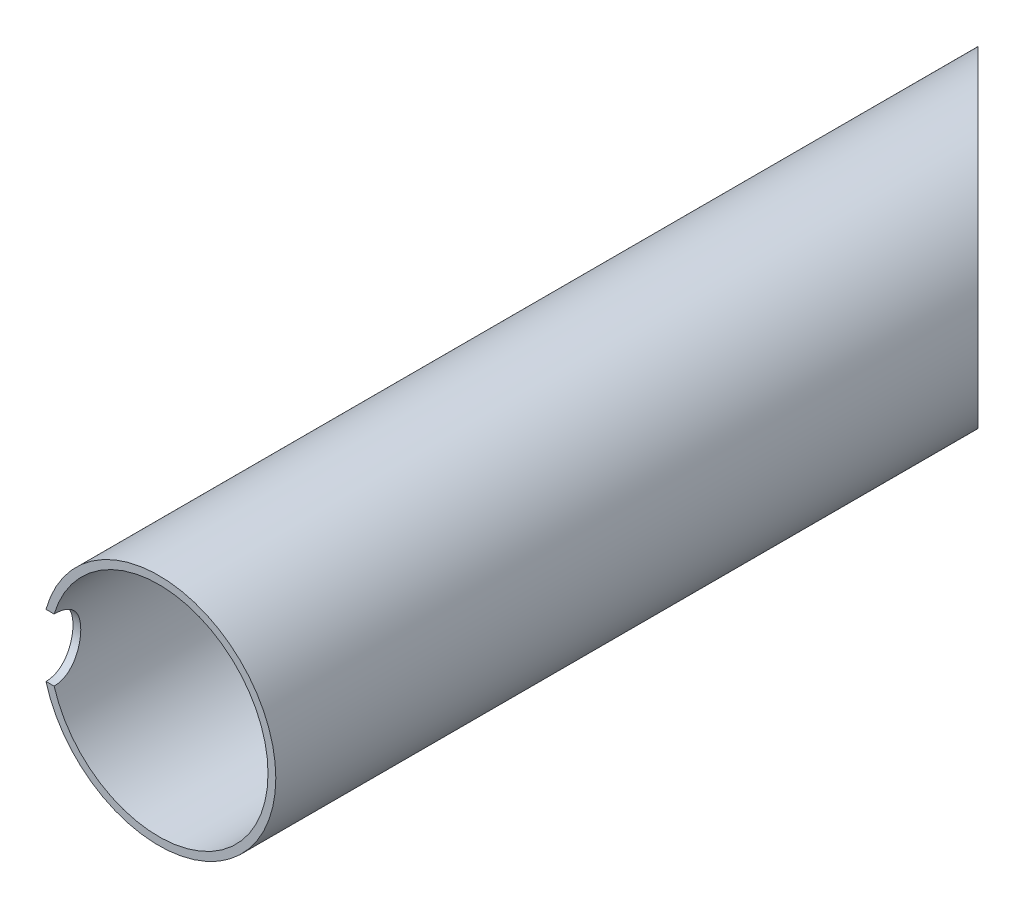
from build123d import *

# Parameters (mm, degrees)
IZIM1_R                     = 15
IZIM1_R_2                   = 14
Y_KSEKLIK_EKSTR_ZYON1_DEPTH = 120
KES_EKSTR_ZYON1_DEPTH       = 60
IZIM3_RX                    = 33.420855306
IZIM3_RY                    = 20.066479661
Y_KSEKLIK_EKSTR_ZYON2_DEPTH = 5
KES_EKSTR_ZYON2_START       = -155
IZIM4_R                     = 35.18425131
IZIM4_R_2                   = 15
KES_EKSTR_ZYON2_DEPTH       = 155
IZIM5_R                     = 1
KES_EKSTR_ZYON3_DEPTH       = 155
IZIM12_R                    = 1.6
KES_EKSTR_ZYON4_DEPTH       = 1.6
KES_EKSTR_ZYON5_DEPTH       = 40.8
KES_EKSTR_ZYON6_DEPTH       = 0.6


with BuildPart() as part:
    # izim1 → Y_kseklik-Ekstr_zyon1 (new body)
    with BuildSketch(Plane.XY):
        Circle(IZIM1_R)
        Circle(IZIM1_R_2, mode=Mode.SUBTRACT)
    extrude(amount=Y_KSEKLIK_EKSTR_ZYON1_DEPTH)

    # izim2 → Kes-Ekstr_zyon1 (cut, symmetric)
    with BuildSketch(Plane(origin=(0, 0, 0), x_dir=(1, 0, 0), z_dir=(0, 1, 0))):
        Polygon((-23.057079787, 8.057079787), (28.666442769, -43.666442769), (30.09373887, 12.111766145), align=None)
    extrude(amount=KES_EKSTR_ZYON1_DEPTH, both=True, mode=Mode.SUBTRACT)

    # izim3 → Y_kseklik-Ekstr_zyon2 (add)
    with BuildSketch(Plane(origin=(-7.5, 0, 7.5), x_dir=(-0.7071067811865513, 0, -0.7071067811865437), z_dir=(0.7071067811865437, 0, -0.7071067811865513))):
        with Locations(Location((-10.606601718, 0), (0, 0, 180))):
            Ellipse(IZIM3_RX, IZIM3_RY)
    extrude(amount=-Y_KSEKLIK_EKSTR_ZYON2_DEPTH)

    # izim4 → Kes-Ekstr_zyon2 (cut)
    with BuildSketch(Plane.XY.offset(120).offset(KES_EKSTR_ZYON2_START)):
        Circle(IZIM4_R)
        Circle(IZIM4_R_2, mode=Mode.SUBTRACT)
    extrude(amount=KES_EKSTR_ZYON2_DEPTH, mode=Mode.SUBTRACT)

    # izim5 → Kes-Ekstr_zyon3 (cut)
    with BuildSketch(Plane.XY.offset(120)):
        with Locations((0, -1.5)):
            Circle(IZIM5_R)
        with Locations((0, 1.5)):
            Circle(IZIM5_R)
    extrude(amount=-KES_EKSTR_ZYON3_DEPTH, mode=Mode.SUBTRACT)

    # izim12 → Kes-Ekstr_zyon4 (cut)
    with BuildSketch(Plane(origin=(-7.5, 0, 7.5), x_dir=(-0.7071067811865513, 0, -0.7071067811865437), z_dir=(0.7071067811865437, 0, -0.7071067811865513))):
        with Locations((-15.606601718, 0)):
            Circle(IZIM12_R)
        with Locations((-10.606601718, 5)):
            Circle(IZIM12_R)
        with Locations((-5.606601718, 0)):
            Circle(IZIM12_R)
        with Locations((-10.606601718, -5)):
            Circle(IZIM12_R)
    extrude(amount=-KES_EKSTR_ZYON4_DEPTH, mode=Mode.SUBTRACT)

    # izim13 → Kes-Ekstr_zyon5 (cut)
    with BuildSketch(Plane(origin=(0, 0, 0), x_dir=(0, 0, -1), z_dir=(1, 0, 0))):
        with BuildLine():
            Line((-120, 4), (-120, -4))
            ThreePointArc((-120, -4), (-116, 0), (-120, 4))
        make_face()
    extrude(amount=-KES_EKSTR_ZYON5_DEPTH, mode=Mode.SUBTRACT)

    # izim14 → Kes-Ekstr_zyon6 (cut)
    # profile 1 of 17: a face of its own
    with BuildSketch(Plane(origin=(-7.5, 0, 7.5), x_dir=(-0.7071067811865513, 0, -0.7071067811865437), z_dir=(0.7071067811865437, 0, -0.7071067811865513))):
        Polygon((3.212581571, 0.541746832), (3.617950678, 0.589967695), (3.345800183, 2.878891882), (2.940431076, 2.830671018), (3.05094347, 1.900320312), (-0.71514321, 1.451835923), (-0.664615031, 1.026086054), (3.101471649, 1.474570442), align=None)
    # profile 2 of 17: a face of its own
    with BuildSketch(Plane(origin=(-7.5, 0, 7.5), x_dir=(-0.7071067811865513, 0, -0.7071067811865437), z_dir=(0.7071067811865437, 0, -0.7071067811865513))):
        with BuildLine():
            Line((2.802049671, 4.661098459), (2.458628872, 5.429420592))
            add(Edge.make_bspline(
                [(2.458628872, 5.429420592), (2.434836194, 5.48241698), (2.389410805, 5.583598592), (2.321782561, 5.727616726), (2.258303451, 5.856933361), (2.199662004, 5.972598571), (2.145332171, 6.074010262), (2.094107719, 6.160722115), (2.048070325, 6.233750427), (2.016617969, 6.276107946), (2.002301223, 6.295388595)],
                knots=[0, 0, 0, 0, 1.42182561, 2.714573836, 3.893992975, 4.947558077, 5.888594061, 6.709116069, 7.412404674, 8, 8, 8, 8], degree=3))
            add(Edge.make_bspline(
                [(2.002301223, 6.295388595), (1.983198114, 6.319297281), (1.945337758, 6.366681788), (1.881809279, 6.430637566), (1.815448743, 6.489585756), (1.744509, 6.541272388), (1.67035911, 6.58729575), (1.592529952, 6.626936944), (1.511373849, 6.661190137), (1.426624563, 6.688066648), (1.339593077, 6.708025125), (1.250724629, 6.720066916), (1.160605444, 6.723704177), (1.069343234, 6.717272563), (0.97707986, 6.705069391), (0.883844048, 6.68229744), (0.789346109, 6.652009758), (0.727069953, 6.62603278), (0.695322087, 6.612789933)],
                knots=[0, 0, 0, 0, 1.006379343, 1.994538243, 2.961990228, 3.924600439, 4.878905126, 5.831031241, 6.795930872, 7.774410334, 8.752889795, 9.730705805, 10.72161913, 11.714843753, 12.737936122, 13.780423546, 14.868478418, 16, 16, 16, 16], degree=3))
            add(Edge.make_bspline(
                [(0.695322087, 6.612789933), (0.664094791, 6.598124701), (0.602999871, 6.569432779), (0.516953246, 6.51931574), (0.438362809, 6.464329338), (0.365820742, 6.405695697), (0.300830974, 6.341934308), (0.242928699, 6.273695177), (0.192780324, 6.200577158), (0.148973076, 6.123946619), (0.112449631, 6.043781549), (0.083827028, 5.960497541), (0.062983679, 5.874405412), (0.048523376, 5.785899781), (0.041579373, 5.695102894), (0.042056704, 5.601963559), (0.049596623, 5.505984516), (0.060418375, 5.441536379), (0.065940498, 5.408649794)],
                knots=[0, 0, 0, 0, 1.118422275, 2.188147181, 3.224311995, 4.226547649, 5.209522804, 6.172459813, 7.124160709, 8.080705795, 9.031700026, 9.976621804, 10.932156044, 11.901009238, 12.881930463, 13.881521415, 14.918983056, 16, 16, 16, 16], degree=3))
            add(Edge.make_bspline(
                [(0.065940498, 5.408649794), (0.07149288, 5.382071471), (0.083622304, 5.324009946), (0.110733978, 5.231546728), (0.144692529, 5.125324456), (0.188687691, 5.006404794), (0.238912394, 4.872914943), (0.29908754, 4.726756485), (0.366663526, 4.566809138), (0.415746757, 4.456438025), (0.441347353, 4.398871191)],
                knots=[0, 0, 0, 0, 0.603676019, 1.318757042, 2.14148026, 3.08378565, 4.138229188, 5.313531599, 6.598804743, 8, 8, 8, 8], degree=3))
            Line((0.441347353, 4.398871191), (0.564698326, 4.123436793))
            Line((0.564698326, 4.123436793), (-1.230448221, 3.321988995))
            Line((-1.230448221, 3.321988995), (-1.058388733, 2.936946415))
            Line((-1.058388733, 2.936946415), (2.802049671, 4.661098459))
        make_face()
        with BuildLine():
            Line((2.254893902, 4.878836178), (0.942688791, 4.292703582))
            Line((0.942688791, 4.292703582), (0.642453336, 4.94270387))
            add(Edge.make_bspline(
                [(0.642453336, 4.94270387), (0.628564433, 4.974728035), (0.601797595, 5.036445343), (0.564608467, 5.126702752), (0.532534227, 5.211465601), (0.507575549, 5.291309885), (0.486181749, 5.364691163), (0.470242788, 5.43274557), (0.459197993, 5.495297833), (0.452681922, 5.570516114), (0.455158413, 5.659359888), (0.474549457, 5.761069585), (0.507753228, 5.858633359), (0.557709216, 5.94911852), (0.620507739, 6.031660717), (0.69384093, 6.105283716), (0.778869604, 6.166947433), (0.84174145, 6.198380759), (0.873532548, 6.214274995)],
                knots=[0, 0, 0, 0, 1.13705786, 2.191349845, 3.179895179, 4.087968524, 4.915685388, 5.669298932, 6.363894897, 6.982767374, 8.126405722, 9.246067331, 10.343972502, 11.469676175, 12.59684769, 13.712906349, 14.84353292, 16, 16, 16, 16], degree=3))
            add(Edge.make_bspline(
                [(0.873532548, 6.214274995), (0.905957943, 6.227383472), (0.970107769, 6.253317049), (1.07158915, 6.27296845), (1.174112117, 6.279883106), (1.276566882, 6.27014413), (1.376041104, 6.247032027), (1.47001674, 6.21103622), (1.55507261, 6.159407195), (1.620144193, 6.105927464), (1.667825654, 6.053218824), (1.706294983, 6.006760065), (1.744339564, 5.95111364), (1.784314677, 5.888661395), (1.824168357, 5.817772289), (1.865995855, 5.739876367), (1.907412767, 5.653210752), (1.93536648, 5.592854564), (1.949841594, 5.561600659)],
                knots=[0, 0, 0, 0, 1.166536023, 2.307854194, 3.436905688, 4.591443, 5.733034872, 6.842145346, 7.939076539, 9.045124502, 9.643034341, 10.312501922, 11.059601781, 11.894069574, 12.790374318, 13.776762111, 14.848753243, 16, 16, 16, 16], degree=3))
            Line((1.949841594, 5.561600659), (2.254893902, 4.878836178))
        make_face(mode=Mode.SUBTRACT)
    # profile 3 of 17: a face of its own
    with BuildSketch(Plane(origin=(-7.5, 0, 7.5), x_dir=(-0.7071067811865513, 0, -0.7071067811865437), z_dir=(0.7071067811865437, 0, -0.7071067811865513))):
        Polygon((-0.924330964, 9.877479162), (-0.664303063, 10.192212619), (-2.44110589, 11.663798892), (-2.701133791, 11.349065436), (-1.978413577, 10.750781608), (-4.400853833, 7.827633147), (-4.070638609, 7.5541244), (-1.648198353, 10.477272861), align=None)
    # profile 4 of 17: a face of its own
    with BuildSketch(Plane(origin=(-7.5, 0, 7.5), x_dir=(-0.7071067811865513, 0, -0.7071067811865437), z_dir=(0.7071067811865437, 0, -0.7071067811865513))):
        with BuildLine():
            Line((-4.012872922, 12.560838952), (-4.785721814, 12.88913188))
            add(Edge.make_bspline(
                [(-4.785721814, 12.88913188), (-4.838712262, 12.911543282), (-4.940450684, 12.954571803), (-5.087015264, 13.014378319), (-5.221592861, 13.065250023), (-5.342741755, 13.110291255), (-5.451636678, 13.146746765), (-5.547469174, 13.176476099), (-5.630653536, 13.198763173), (-5.682490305, 13.208050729), (-5.706115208, 13.212283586)],
                knots=[0, 0, 0, 0, 1.413041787, 2.71295386, 3.88734424, 4.946346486, 5.887083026, 6.707106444, 7.410756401, 8, 8, 8, 8], degree=3))
            add(Edge.make_bspline(
                [(-5.706115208, 13.212283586), (-5.736423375, 13.216547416), (-5.796457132, 13.224993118), (-5.886338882, 13.228963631), (-5.974483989, 13.225471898), (-6.061142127, 13.217121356), (-6.146277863, 13.199439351), (-6.230251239, 13.176467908), (-6.312544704, 13.145252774), (-6.392785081, 13.107484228), (-6.470248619, 13.063400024), (-6.543141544, 13.01189515), (-6.61061412, 12.952933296), (-6.674505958, 12.888281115), (-6.731651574, 12.815080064), (-6.785194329, 12.736078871), (-6.833885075, 12.650014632), (-6.861163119, 12.588783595), (-6.875036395, 12.557642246)],
                knots=[0, 0, 0, 0, 1.010908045, 2.002384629, 2.967464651, 3.924374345, 4.875110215, 5.83674901, 6.798387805, 7.779159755, 8.764679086, 9.739741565, 10.722646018, 11.722228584, 12.738258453, 13.786034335, 14.874004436, 16, 16, 16, 16], degree=3))
            add(Edge.make_bspline(
                [(-6.875036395, 12.557642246), (-6.887904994, 12.52571103), (-6.91302298, 12.463385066), (-6.941821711, 12.36843936), (-6.962833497, 12.275403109), (-6.975980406, 12.183417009), (-6.978886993, 12.093086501), (-6.975728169, 12.004143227), (-6.963425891, 11.916719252), (-6.943061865, 11.831057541), (-6.914434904, 11.748012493), (-6.879292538, 11.667571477), (-6.837648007, 11.589711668), (-6.786599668, 11.516439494), (-6.731101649, 11.444738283), (-6.667019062, 11.37726307), (-6.597045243, 11.311631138), (-6.545437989, 11.272046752), (-6.519215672, 11.251933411)],
                knots=[0, 0, 0, 0, 1.12058794, 2.187255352, 3.226443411, 4.224288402, 5.207636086, 6.165494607, 7.119097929, 8.077310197, 9.028288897, 9.975294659, 10.933683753, 11.897758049, 12.879683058, 13.883369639, 14.924512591, 16, 16, 16, 16], degree=3))
            add(Edge.make_bspline(
                [(-6.519215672, 11.251933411), (-6.497114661, 11.236308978), (-6.448802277, 11.202154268), (-6.36563112, 11.153693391), (-6.268916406, 11.098588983), (-6.156257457, 11.040689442), (-6.028177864, 10.979412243), (-5.885862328, 10.912084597), (-5.727852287, 10.842043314), (-5.617237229, 10.79445581), (-5.559568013, 10.76964604)],
                knots=[0, 0, 0, 0, 0.603576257, 1.319406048, 2.145814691, 3.087144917, 4.144297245, 5.313491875, 6.59938763, 8, 8, 8, 8], degree=3))
            Line((-5.559568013, 10.76964604), (-5.283211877, 10.651711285))
            Line((-5.283211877, 10.651711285), (-6.049829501, 8.848200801))
            Line((-6.049829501, 8.848200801), (-5.661609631, 8.683444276))
            Line((-5.661609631, 8.683444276), (-4.012872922, 12.560838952))
        make_face()
        with BuildLine():
            Line((-4.561585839, 12.348744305), (-5.121505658, 11.030954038))
            Line((-5.121505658, 11.030954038), (-5.78135412, 11.301624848))
            add(Edge.make_bspline(
                [(-5.78135412, 11.301624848), (-5.813270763, 11.315756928), (-5.874711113, 11.342961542), (-5.963334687, 11.383045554), (-6.043364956, 11.424958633), (-6.116706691, 11.46457968), (-6.181424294, 11.505160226), (-6.239318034, 11.543589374), (-6.289468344, 11.582068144), (-6.345516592, 11.632258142), (-6.404310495, 11.698257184), (-6.458823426, 11.785719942), (-6.499749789, 11.87937835), (-6.52562298, 11.979121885), (-6.534951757, 12.08208604), (-6.532440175, 12.185583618), (-6.511252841, 12.288291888), (-6.486731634, 12.353989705), (-6.474255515, 12.387416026)],
                knots=[0, 0, 0, 0, 1.141095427, 2.196637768, 3.178462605, 4.093627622, 4.920623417, 5.674488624, 6.364487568, 6.984691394, 8.132315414, 9.239805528, 10.339753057, 11.461833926, 12.591800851, 13.709574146, 14.83465671, 16, 16, 16, 16], degree=3))
            add(Edge.make_bspline(
                [(-6.474255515, 12.387416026), (-6.459636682, 12.418838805), (-6.430700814, 12.481035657), (-6.370703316, 12.564720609), (-6.299685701, 12.638784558), (-6.217807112, 12.701225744), (-6.129611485, 12.752251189), (-6.036562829, 12.789128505), (-5.939779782, 12.809923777), (-5.85614394, 12.813347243), (-5.785313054, 12.809404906), (-5.72596287, 12.799347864), (-5.660574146, 12.78478445), (-5.588880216, 12.767081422), (-5.512127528, 12.741508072), (-5.428665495, 12.713205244), (-5.339222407, 12.679170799), (-5.2781235, 12.653325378), (-5.246500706, 12.639948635)],
                knots=[0, 0, 0, 0, 1.160691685, 2.297421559, 3.435891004, 4.592273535, 5.740224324, 6.844848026, 7.936694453, 9.044895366, 9.642706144, 10.314217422, 11.061311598, 11.89084748, 12.790205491, 13.774242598, 14.848020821, 16, 16, 16, 16], degree=3))
            Line((-5.246500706, 12.639948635), (-4.561585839, 12.348744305))
        make_face(mode=Mode.SUBTRACT)
    # profile 5 of 17: a face of its own
    with BuildSketch(Plane(origin=(-7.5, 0, 7.5), x_dir=(-0.7071067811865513, 0, -0.7071067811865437), z_dir=(0.7071067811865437, 0, -0.7071067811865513))):
        Polygon((-10.331062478, 13.840611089), (-10.357291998, 14.250156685), (-12.667220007, 14.103749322), (-12.640990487, 13.694203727), (-11.702316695, 13.754116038), (-11.461961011, 9.95335121), (-11.032852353, 9.980349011), (-11.273208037, 13.781113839), align=None)
    # profile 6 of 17: a face of its own
    with BuildSketch(Plane(origin=(-7.5, 0, 7.5), x_dir=(-0.7071067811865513, 0, -0.7071067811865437), z_dir=(0.7071067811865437, 0, -0.7071067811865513))):
        with BuildLine():
            Line((-14.443033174, 13.644421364), (-15.227358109, 13.349051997))
            add(Edge.make_bspline(
                [(-15.227358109, 13.349051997), (-15.281269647, 13.328763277), (-15.384550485, 13.289895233), (-15.531133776, 13.230689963), (-15.664047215, 13.175898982), (-15.781983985, 13.12358606), (-15.886568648, 13.076145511), (-15.975566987, 13.03019873), (-16.051206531, 12.988817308), (-16.095298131, 12.960038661), (-16.115425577, 12.946901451)],
                knots=[0, 0, 0, 0, 1.415562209, 2.7118583, 3.884955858, 4.948350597, 5.882570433, 6.706471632, 7.409515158, 8, 8, 8, 8], degree=3))
            add(Edge.make_bspline(
                [(-16.115425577, 12.946901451), (-16.140111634, 12.929227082), (-16.18893818, 12.894268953), (-16.256817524, 12.836080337), (-16.317867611, 12.77258536), (-16.374916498, 12.706925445), (-16.42404525, 12.635536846), (-16.468516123, 12.561065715), (-16.505575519, 12.481447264), (-16.538301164, 12.399126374), (-16.564314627, 12.313925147), (-16.579539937, 12.225972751), (-16.588586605, 12.136974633), (-16.590077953, 12.046240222), (-16.581195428, 11.953999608), (-16.563922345, 11.860332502), (-16.540889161, 11.764500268), (-16.518263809, 11.701695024), (-16.506744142, 11.669717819)],
                knots=[0, 0, 0, 0, 1.005680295, 1.989134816, 2.956718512, 3.922305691, 4.867278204, 5.823921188, 6.792999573, 7.773193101, 8.758029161, 9.738043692, 10.725370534, 11.720176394, 12.73928657, 13.789761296, 14.874659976, 16, 16, 16, 16], degree=3))
            add(Edge.make_bspline(
                [(-16.506744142, 11.669717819), (-16.494122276, 11.637775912), (-16.469374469, 11.57514712), (-16.424107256, 11.487063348), (-16.375580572, 11.405031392), (-16.321226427, 11.329972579), (-16.2613583, 11.262091), (-16.1975145, 11.200159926), (-16.127941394, 11.146187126), (-16.054467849, 11.098024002), (-15.976830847, 11.057060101), (-15.895807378, 11.023118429), (-15.811970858, 10.996930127), (-15.725066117, 10.977114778), (-15.635203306, 10.964866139), (-15.542329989, 10.959248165), (-15.446588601, 10.961675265), (-15.382228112, 10.968092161), (-15.349422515, 10.971362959)],
                knots=[0, 0, 0, 0, 1.11923811, 2.194500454, 3.224982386, 4.224666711, 5.210876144, 6.173017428, 7.120253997, 8.077393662, 9.034267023, 9.978224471, 10.937713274, 11.894542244, 12.881268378, 13.891477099, 14.925251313, 16, 16, 16, 16], degree=3))
            add(Edge.make_bspline(
                [(-15.349422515, 10.971362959), (-15.322646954, 10.975314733), (-15.264191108, 10.983942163), (-15.170378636, 11.005135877), (-15.062782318, 11.032666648), (-14.941987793, 11.069843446), (-14.806183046, 11.11108758), (-14.657479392, 11.162782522), (-14.494678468, 11.220429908), (-14.382206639, 11.262584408), (-14.323558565, 11.284565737)],
                knots=[0, 0, 0, 0, 0.604392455, 1.319496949, 2.146884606, 3.084911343, 4.142115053, 5.317063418, 6.600991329, 8, 8, 8, 8], degree=3))
            Line((-14.323558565, 11.284565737), (-14.043192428, 11.390596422))
            Line((-14.043192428, 11.390596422), (-13.353624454, 9.560079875))
            Line((-13.353624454, 9.560079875), (-12.95994649, 9.707965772))
            Line((-12.95994649, 9.707965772), (-14.443033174, 13.644421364))
        make_face()
        with BuildLine():
            Line((-14.692906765, 13.113941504), (-14.188036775, 11.775662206))
            Line((-14.188036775, 11.775662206), (-14.851623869, 11.516253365))
            add(Edge.make_bspline(
                [(-14.851623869, 11.516253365), (-14.884390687, 11.504209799), (-14.94736527, 11.481063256), (-15.03956746, 11.450286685), (-15.12543152, 11.423709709), (-15.20604878, 11.403536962), (-15.280006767, 11.386017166), (-15.34867719, 11.375083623), (-15.411244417, 11.36769046), (-15.486466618, 11.366566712), (-15.574353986, 11.374006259), (-15.674969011, 11.397874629), (-15.76916937, 11.438263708), (-15.856491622, 11.493028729), (-15.935399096, 11.559831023), (-16.003836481, 11.637484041), (-16.059589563, 11.725869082), (-16.08686167, 11.790163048), (-16.10070708, 11.822803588)],
                knots=[0, 0, 0, 0, 1.142502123, 2.195776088, 3.181202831, 4.08318542, 4.915325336, 5.667507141, 6.357984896, 6.975151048, 8.126831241, 9.235686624, 10.344657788, 11.465643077, 12.59741901, 13.716876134, 14.840911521, 16, 16, 16, 16], degree=3))
            add(Edge.make_bspline(
                [(-16.10070708, 11.822803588), (-16.111530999, 11.855648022), (-16.132874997, 11.920414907), (-16.147840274, 12.021761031), (-16.148022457, 12.123857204), (-16.131867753, 12.225152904), (-16.10308663, 12.322664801), (-16.061089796, 12.413337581), (-16.005493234, 12.495351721), (-15.947993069, 12.556454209), (-15.892906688, 12.601214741), (-15.844029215, 12.636193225), (-15.787196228, 12.67083244), (-15.722812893, 12.70707997), (-15.650071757, 12.742215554), (-15.569639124, 12.778842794), (-15.481496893, 12.81538779), (-15.419838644, 12.839369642), (-15.387922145, 12.8517835)],
                knots=[0, 0, 0, 0, 1.16083445, 2.289082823, 3.427093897, 4.580553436, 5.724855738, 6.835436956, 7.925665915, 9.042409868, 9.641395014, 10.309916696, 11.061368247, 11.877734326, 12.79288018, 13.775915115, 14.848734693, 16, 16, 16, 16], degree=3))
            Line((-15.387922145, 12.8517835), (-14.692906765, 13.113941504))
        make_face(mode=Mode.SUBTRACT)
    # profile 7 of 17: a face of its own
    with BuildSketch(Plane(origin=(-7.5, 0, 7.5), x_dir=(-0.7071067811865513, 0, -0.7071067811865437), z_dir=(0.7071067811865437, 0, -0.7071067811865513))):
        Polygon((-19.893857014, 10.265111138), (-20.193783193, 10.545193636), (-21.775311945, 8.855049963), (-21.475385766, 8.574967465), (-20.832618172, 9.261898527), (-18.052239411, 6.659852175), (-17.758615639, 6.973426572), (-20.5389944, 9.575472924), align=None)
    # profile 8 of 17: a face of its own
    with BuildSketch(Plane(origin=(-7.5, 0, 7.5), x_dir=(-0.7071067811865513, 0, -0.7071067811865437), z_dir=(0.7071067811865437, 0, -0.7071067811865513))):
        with BuildLine():
            Line((-22.754002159, 7.310488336), (-23.123110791, 6.557550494))
            add(Edge.make_bspline(
                [(-23.123110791, 6.557550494), (-23.148337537, 6.5055771), (-23.196584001, 6.406177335), (-23.264039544, 6.26296357), (-23.322234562, 6.131729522), (-23.372912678, 6.013018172), (-23.416596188, 5.907205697), (-23.45029564, 5.812982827), (-23.476316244, 5.731202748), (-23.488879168, 5.680115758), (-23.494605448, 5.656829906)],
                knots=[0, 0, 0, 0, 1.420601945, 2.716918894, 3.892440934, 4.95036944, 5.891001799, 6.706657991, 7.410484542, 8, 8, 8, 8], degree=3))
            add(Edge.make_bspline(
                [(-23.494605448, 5.656829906), (-23.50054204, 5.626969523), (-23.512331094, 5.567671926), (-23.52043907, 5.478190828), (-23.523910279, 5.389784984), (-23.518286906, 5.302801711), (-23.505813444, 5.216856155), (-23.487244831, 5.132108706), (-23.461377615, 5.048184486), (-23.427487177, 4.966580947), (-23.387735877, 4.886727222), (-23.339876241, 4.811289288), (-23.284453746, 4.740468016), (-23.223382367, 4.673056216), (-23.153378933, 4.612025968), (-23.077798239, 4.554000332), (-22.993968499, 4.502020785), (-22.934636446, 4.471178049), (-22.904429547, 4.455475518)],
                knots=[0, 0, 0, 0, 1.006017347, 1.99777787, 2.967174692, 3.929016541, 4.875059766, 5.83671993, 6.795058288, 7.774720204, 8.755451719, 9.741336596, 10.722780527, 11.726450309, 12.743909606, 13.789154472, 14.874423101, 16, 16, 16, 16], degree=3))
            add(Edge.make_bspline(
                [(-22.904429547, 4.455475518), (-22.873358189, 4.4409916), (-22.812349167, 4.412552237), (-22.719271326, 4.378411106), (-22.627103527, 4.352747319), (-22.536170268, 4.334971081), (-22.44601496, 4.325640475), (-22.357012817, 4.326368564), (-22.269042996, 4.333865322), (-22.182382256, 4.349353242), (-22.098008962, 4.373550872), (-22.015309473, 4.403481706), (-21.936078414, 4.441851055), (-21.859172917, 4.487083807), (-21.7858621, 4.540237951), (-21.714328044, 4.599734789), (-21.645934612, 4.666927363), (-21.603232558, 4.715842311), (-21.581495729, 4.74074172)],
                knots=[0, 0, 0, 0, 1.116161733, 2.191598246, 3.224582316, 4.229238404, 5.206090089, 6.171025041, 7.123582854, 8.078939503, 9.032919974, 9.979228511, 10.939893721, 11.895693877, 12.881485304, 13.885677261, 14.923736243, 16, 16, 16, 16], degree=3))
            add(Edge.make_bspline(
                [(-21.581495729, 4.74074172), (-21.564833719, 4.761842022), (-21.528276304, 4.808137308), (-21.475022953, 4.888096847), (-21.415886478, 4.982461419), (-21.351595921, 5.091460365), (-21.281974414, 5.215107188), (-21.208676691, 5.354296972), (-21.129022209, 5.507743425), (-21.075986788, 5.615952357), (-21.048332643, 5.672375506)],
                knots=[0, 0, 0, 0, 0.599952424, 1.316330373, 2.142777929, 3.086040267, 4.140800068, 5.31006728, 6.597394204, 8, 8, 8, 8], degree=3))
            Line((-21.048332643, 5.672375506), (-20.915748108, 5.941487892))
            Line((-20.915748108, 5.941487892), (-19.158373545, 5.07956422))
            Line((-19.158373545, 5.07956422), (-18.973408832, 5.456887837))
            Line((-18.973408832, 5.456887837), (-22.754002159, 7.310488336))
        make_face()
        with BuildLine():
            Line((-22.571899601, 6.753124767), (-21.286904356, 6.122649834))
            Line((-21.286904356, 6.122649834), (-21.593143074, 5.479617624))
            add(Edge.make_bspline(
                [(-21.593143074, 5.479617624), (-21.608623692, 5.44848389), (-21.638582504, 5.388232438), (-21.684210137, 5.302069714), (-21.729981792, 5.224065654), (-21.773561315, 5.153270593), (-21.816847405, 5.090364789), (-21.859310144, 5.035131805), (-21.900039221, 4.986669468), (-21.953474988, 4.934061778), (-22.022500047, 4.879127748), (-22.112467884, 4.828842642), (-22.208618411, 4.793861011), (-22.309390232, 4.773396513), (-22.412524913, 4.768803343), (-22.515414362, 4.777575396), (-22.616831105, 4.803256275), (-22.680971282, 4.831566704), (-22.713568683, 4.845954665)],
                knots=[0, 0, 0, 0, 1.137301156, 2.200958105, 3.188208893, 4.095075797, 4.919686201, 5.684429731, 6.373492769, 6.988198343, 8.134745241, 9.247540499, 10.344084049, 11.468799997, 12.597423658, 13.70956572, 14.835952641, 16, 16, 16, 16], degree=3))
            add(Edge.make_bspline(
                [(-22.713568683, 4.845954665), (-22.743955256, 4.86237153), (-22.804122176, 4.894877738), (-22.884582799, 4.958583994), (-22.954350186, 5.033578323), (-23.013290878, 5.117919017), (-23.059621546, 5.20865369), (-23.09090019, 5.303944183), (-23.106462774, 5.401768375), (-23.106089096, 5.486090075), (-23.096845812, 5.556384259), (-23.085253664, 5.615362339), (-23.066818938, 5.679492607), (-23.043925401, 5.749748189), (-23.016487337, 5.82590765), (-22.981953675, 5.907196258), (-22.942575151, 5.9941942), (-22.914148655, 6.054039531), (-22.899448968, 6.084986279)],
                knots=[0, 0, 0, 0, 1.157511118, 2.291929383, 3.425752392, 4.584623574, 5.734527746, 6.832864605, 7.936841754, 9.04521302, 9.648992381, 10.314807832, 11.060525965, 11.886808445, 12.794933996, 13.776372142, 14.850134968, 16, 16, 16, 16], degree=3))
            Line((-22.899448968, 6.084986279), (-22.571899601, 6.753124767))
        make_face(mode=Mode.SUBTRACT)
    # profile 9 of 17: a face of its own
    with BuildSketch(Plane(origin=(-7.5, 0, 7.5), x_dir=(-0.7071067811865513, 0, -0.7071067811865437), z_dir=(0.7071067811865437, 0, -0.7071067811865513))):
        Polygon((-24.396983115, 1.115613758), (-24.806577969, 1.114552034), (-24.800047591, -1.195458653), (-24.390452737, -1.194396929), (-24.393133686, -0.255637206), (-20.592302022, -0.244699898), (-20.593454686, 0.184399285), (-24.39428635, 0.173461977), align=None)
    # profile 10 of 17: a face of its own
    with BuildSketch(Plane(origin=(-7.5, 0, 7.5), x_dir=(-0.7071067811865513, 0, -0.7071067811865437), z_dir=(0.7071067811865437, 0, -0.7071067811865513))):
        with BuildLine():
            Line((-24.455645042, -2.990026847), (-24.209311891, -3.789587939))
            add(Edge.make_bspline(
                [(-24.209311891, -3.789587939), (-24.192352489, -3.844626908), (-24.159899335, -3.949948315), (-24.109489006, -4.099693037), (-24.064549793, -4.235677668), (-24.018737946, -4.35612018), (-23.977822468, -4.462695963), (-23.938031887, -4.554391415), (-23.90160981, -4.631847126), (-23.875846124, -4.677534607), (-23.864126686, -4.698317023)],
                knots=[0, 0, 0, 0, 1.419418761, 2.716169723, 3.894297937, 4.948733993, 5.891850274, 6.707601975, 7.412111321, 8, 8, 8, 8], degree=3))
            add(Edge.make_bspline(
                [(-23.864126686, -4.698317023), (-23.847851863, -4.724174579), (-23.8157312, -4.775208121), (-23.760581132, -4.84596631), (-23.702891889, -4.912554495), (-23.63931583, -4.972135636), (-23.571642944, -5.026257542), (-23.499655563, -5.074503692), (-23.42369139, -5.118177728), (-23.343383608, -5.155335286), (-23.259390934, -5.185296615), (-23.173223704, -5.207890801), (-23.084772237, -5.222692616), (-22.994234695, -5.226864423), (-22.901523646, -5.225208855), (-22.806912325, -5.214887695), (-22.709965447, -5.196830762), (-22.645894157, -5.178081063), (-22.61318863, -5.16851018)],
                knots=[0, 0, 0, 0, 1.011171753, 1.99569033, 2.967532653, 3.926028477, 4.876490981, 5.834300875, 6.793025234, 7.775539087, 8.760413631, 9.742302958, 10.722316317, 11.723997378, 12.739234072, 13.790431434, 14.872114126, 16, 16, 16, 16], degree=3))
            add(Edge.make_bspline(
                [(-22.61318863, -5.16851018), (-22.580572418, -5.157897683), (-22.516736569, -5.137127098), (-22.425942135, -5.09804372), (-22.342131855, -5.052785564), (-22.263334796, -5.004723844), (-22.192918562, -4.94842287), (-22.127121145, -4.889018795), (-22.068163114, -4.823426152), (-22.017018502, -4.751944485), (-21.971334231, -4.677068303), (-21.932837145, -4.598335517), (-21.900081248, -4.516690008), (-21.87666353, -4.431143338), (-21.858052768, -4.342452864), (-21.847640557, -4.250168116), (-21.843281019, -4.154457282), (-21.845897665, -4.089834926), (-21.847230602, -4.056915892)],
                knots=[0, 0, 0, 0, 1.11966604, 2.19138974, 3.221975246, 4.22880634, 5.200188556, 6.160987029, 7.121430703, 8.073319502, 9.027488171, 9.982370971, 10.932243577, 11.895477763, 12.874635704, 13.888886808, 14.924585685, 16, 16, 16, 16], degree=3))
            add(Edge.make_bspline(
                [(-21.847230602, -4.056915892), (-21.84988087, -4.03010863), (-21.855653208, -3.971721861), (-21.869344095, -3.876849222), (-21.892473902, -3.768412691), (-21.918964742, -3.644888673), (-21.954620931, -3.508194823), (-21.995707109, -3.356686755), (-22.04292289, -3.191002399), (-22.07816935, -3.076042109), (-22.096488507, -3.016292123)],
                knots=[0, 0, 0, 0, 0.603192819, 1.313766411, 2.144923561, 3.085254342, 4.142499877, 5.307525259, 6.600600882, 8, 8, 8, 8], degree=3))
            Line((-22.096488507, -3.016292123), (-22.184743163, -2.729678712))
            Line((-22.184743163, -2.729678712), (-20.317772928, -2.154340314))
            Line((-20.317772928, -2.154340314), (-20.440953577, -1.753031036))
            Line((-20.440953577, -1.753031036), (-24.455645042, -2.990026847))
        make_face()
        with BuildLine():
            Line((-23.942655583, -3.270848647), (-22.577609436, -2.850194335))
            Line((-22.577609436, -2.850194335), (-22.359218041, -3.527233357))
            add(Edge.make_bspline(
                [(-22.359218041, -3.527233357), (-22.349462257, -3.560607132), (-22.330652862, -3.624952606), (-22.304051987, -3.718406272), (-22.285136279, -3.806379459), (-22.26784007, -3.887702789), (-22.257295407, -3.963023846), (-22.24838047, -4.032036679), (-22.247016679, -4.095030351), (-22.248437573, -4.169991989), (-22.261929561, -4.257190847), (-22.291807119, -4.355817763), (-22.338051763, -4.447296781), (-22.398011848, -4.530685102), (-22.46931819, -4.605168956), (-22.551260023, -4.667479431), (-22.641473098, -4.719820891), (-22.707597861, -4.742533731), (-22.741194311, -4.754073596)],
                knots=[0, 0, 0, 0, 1.139628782, 2.197232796, 3.182972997, 4.088009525, 4.92084711, 5.675056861, 6.366393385, 6.983479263, 8.130763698, 9.244801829, 10.347963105, 11.473459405, 12.59994656, 13.713522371, 14.838294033, 16, 16, 16, 16], degree=3))
            add(Edge.make_bspline(
                [(-22.741194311, -4.754073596), (-22.774641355, -4.762905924), (-22.84068234, -4.780345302), (-22.942691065, -4.788992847), (-23.044525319, -4.782595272), (-23.144626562, -4.760831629), (-23.24020157, -4.725895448), (-23.327813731, -4.677904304), (-23.406331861, -4.617584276), (-23.464413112, -4.557000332), (-23.505888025, -4.499452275), (-23.537126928, -4.448436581), (-23.568909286, -4.389854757), (-23.599286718, -4.32281551), (-23.631608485, -4.248805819), (-23.662711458, -4.166359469), (-23.693188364, -4.075875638), (-23.713325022, -4.012888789), (-23.72373022, -3.980341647)],
                knots=[0, 0, 0, 0, 1.162011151, 2.294383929, 3.426157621, 4.583021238, 5.72825779, 6.838249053, 7.929839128, 9.047623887, 9.647015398, 10.313281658, 11.058902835, 11.887473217, 12.788256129, 13.775444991, 14.850507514, 16, 16, 16, 16], degree=3))
            Line((-23.72373022, -3.980341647), (-23.942655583, -3.270848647))
        make_face(mode=Mode.SUBTRACT)
    # profile 11 of 17: a face of its own
    with BuildSketch(Plane(origin=(-7.5, 0, 7.5), x_dir=(-0.7071067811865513, 0, -0.7071067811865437), z_dir=(0.7071067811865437, 0, -0.7071067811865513))):
        Polygon((-21.406171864, -8.613958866), (-21.70241357, -8.893508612), (-20.126048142, -10.564125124), (-19.829806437, -10.284575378), (-20.47058145, -9.605043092), (-17.721880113, -7.012258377), (-18.015050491, -6.701649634), (-20.763751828, -9.294434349), align=None)
    # profile 12 of 17: a face of its own
    with BuildSketch(Plane(origin=(-7.5, 0, 7.5), x_dir=(-0.7071067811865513, 0, -0.7071067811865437), z_dir=(0.7071067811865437, 0, -0.7071067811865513))):
        with BuildLine():
            Line((-18.65471096, -11.676939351), (-17.925029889, -12.092444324))
            add(Edge.make_bspline(
                [(-17.925029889, -12.092444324), (-17.874717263, -12.120786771), (-17.778364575, -12.175064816), (-17.639582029, -12.25152101), (-17.512058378, -12.318046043), (-17.396181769, -12.375284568), (-17.292278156, -12.424140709), (-17.200291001, -12.464527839), (-17.120196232, -12.496143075), (-17.069846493, -12.511461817), (-17.047043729, -12.518399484)],
                knots=[0, 0, 0, 0, 1.417722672, 2.715051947, 3.889859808, 4.948571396, 5.887892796, 6.708354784, 7.415030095, 8, 8, 8, 8], degree=3))
            add(Edge.make_bspline(
                [(-17.047043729, -12.518399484), (-17.017470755, -12.52627223), (-16.958989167, -12.54184086), (-16.870097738, -12.555603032), (-16.782182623, -12.564216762), (-16.694700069, -12.564689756), (-16.608031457, -12.557222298), (-16.521834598, -12.544035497), (-16.436641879, -12.522817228), (-16.352882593, -12.494397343), (-16.270657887, -12.4602908), (-16.193108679, -12.41615372), (-16.118186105, -12.366472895), (-16.048767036, -12.307503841), (-15.982272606, -12.242587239), (-15.920623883, -12.169936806), (-15.862856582, -12.090062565), (-15.828682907, -12.032631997), (-15.811218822, -12.003282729)],
                knots=[0, 0, 0, 0, 1.010570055, 1.998437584, 2.968120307, 3.927672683, 4.884310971, 5.840036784, 6.80629433, 7.780957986, 8.761155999, 9.742332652, 10.724709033, 11.727478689, 12.746945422, 13.792606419, 14.871935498, 16, 16, 16, 16], degree=3))
            add(Edge.make_bspline(
                [(-15.811218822, -12.003282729), (-15.794513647, -11.973221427), (-15.761869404, -11.91447745), (-15.722919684, -11.823220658), (-15.691893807, -11.732669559), (-15.667997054, -11.642923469), (-15.653304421, -11.553595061), (-15.647939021, -11.465031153), (-15.649354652, -11.3768406), (-15.660131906, -11.289498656), (-15.678931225, -11.203450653), (-15.703891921, -11.119145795), (-15.738101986, -11.037600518), (-15.778282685, -10.957946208), (-15.826364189, -10.880556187), (-15.88217855, -10.806038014), (-15.943800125, -10.732531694), (-15.990607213, -10.687638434), (-16.014423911, -10.664795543)],
                knots=[0, 0, 0, 0, 1.118731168, 2.186156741, 3.224029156, 4.232447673, 5.205492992, 6.165047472, 7.116807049, 8.072472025, 9.023875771, 9.981178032, 10.929730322, 11.897935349, 12.882569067, 13.890525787, 14.926643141, 16, 16, 16, 16], degree=3))
            add(Edge.make_bspline(
                [(-16.014423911, -10.664795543), (-16.034662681, -10.646782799), (-16.078710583, -10.607579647), (-16.155225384, -10.549200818), (-16.245126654, -10.483760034), (-16.349750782, -10.412604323), (-16.469721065, -10.336876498), (-16.60340278, -10.253973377), (-16.752071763, -10.165384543), (-16.856659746, -10.105630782), (-16.911277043, -10.074426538)],
                knots=[0, 0, 0, 0, 0.604426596, 1.315481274, 2.146260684, 3.086019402, 4.138281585, 5.312012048, 6.596295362, 8, 8, 8, 8], degree=3))
            Line((-16.911277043, -10.074426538), (-17.172354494, -9.925822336))
            Line((-17.172354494, -9.925822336), (-16.203276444, -8.222504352))
            Line((-16.203276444, -8.222504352), (-16.569860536, -8.014308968))
            Line((-16.569860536, -8.014308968), (-18.65471096, -11.676939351))
        make_face()
        with BuildLine():
            Line((-18.085208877, -11.529583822), (-17.376591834, -10.284131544))
            Line((-17.376591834, -10.284131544), (-16.752813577, -10.629427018))
            add(Edge.make_bspline(
                [(-16.752813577, -10.629427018), (-16.722523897, -10.646815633), (-16.664052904, -10.680382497), (-16.581187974, -10.73180635), (-16.505852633, -10.781653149), (-16.438385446, -10.830584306), (-16.37767634, -10.877136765), (-16.324760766, -10.922712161), (-16.279329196, -10.966817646), (-16.230039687, -11.023627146), (-16.179147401, -11.095667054), (-16.133968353, -11.188398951), (-16.104514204, -11.286528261), (-16.091290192, -11.388863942), (-16.093039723, -11.492256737), (-16.10856464, -11.594720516), (-16.140696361, -11.694566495), (-16.173233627, -11.756834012), (-16.189703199, -11.788352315)],
                knots=[0, 0, 0, 0, 1.140467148, 2.201550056, 3.184206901, 4.089644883, 4.922739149, 5.681704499, 6.369088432, 6.988322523, 8.135977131, 9.238337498, 10.34208837, 11.466907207, 12.594147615, 13.708692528, 14.840195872, 16, 16, 16, 16], degree=3))
            add(Edge.make_bspline(
                [(-16.189703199, -11.788352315), (-16.207914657, -11.81774274), (-16.243956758, -11.875909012), (-16.312795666, -11.951995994), (-16.391104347, -12.017980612), (-16.479363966, -12.070835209), (-16.572969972, -12.111474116), (-16.670031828, -12.136247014), (-16.768566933, -12.145694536), (-16.85238932, -12.141132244), (-16.922199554, -12.126919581), (-16.980302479, -12.111604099), (-17.043793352, -12.090082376), (-17.112652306, -12.063485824), (-17.18663659, -12.03006478), (-17.265905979, -11.990983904), (-17.351253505, -11.947583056), (-17.408963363, -11.914872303), (-17.438829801, -11.897943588)],
                knots=[0, 0, 0, 0, 1.157754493, 2.291299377, 3.424566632, 4.581388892, 5.729278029, 6.836380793, 7.926461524, 9.038911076, 9.636567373, 10.313771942, 11.053233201, 11.884016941, 12.788973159, 13.775174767, 14.848591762, 16, 16, 16, 16], degree=3))
            Line((-17.438829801, -11.897943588), (-18.085208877, -11.529583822))
        make_face(mode=Mode.SUBTRACT)
    # profile 13 of 17: a face of its own
    with BuildSketch(Plane(origin=(-7.5, 0, 7.5), x_dir=(-0.7071067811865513, 0, -0.7071067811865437), z_dir=(0.7071067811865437, 0, -0.7071067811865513))):
        Polygon((-12.567241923, -13.702876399), (-12.592156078, -14.112353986), (-10.282239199, -14.248040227), (-10.257325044, -13.838562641), (-11.196026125, -13.783245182), (-10.971955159, -9.982662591), (-11.401100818, -9.958005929), (-11.625171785, -13.75858852), align=None)
    # profile 14 of 17: a face of its own
    with BuildSketch(Plane(origin=(-7.5, 0, 7.5), x_dir=(-0.7071067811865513, 0, -0.7071067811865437), z_dir=(0.7071067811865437, 0, -0.7071067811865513))):
        with BuildLine():
            Line((-8.461840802, -14.01715284), (-7.646701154, -13.819493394))
            add(Edge.make_bspline(
                [(-7.646701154, -13.819493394), (-7.590592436, -13.80561067), (-7.483290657, -13.77906148), (-7.329944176, -13.739005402), (-7.191138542, -13.701281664), (-7.067507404, -13.663758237), (-6.958251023, -13.629142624), (-6.864239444, -13.594697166), (-6.784233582, -13.562863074), (-6.73682338, -13.539802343), (-6.715196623, -13.529282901)],
                knots=[0, 0, 0, 0, 1.419355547, 2.714362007, 3.891978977, 4.951183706, 5.886943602, 6.705742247, 7.409608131, 8, 8, 8, 8], degree=3))
            add(Edge.make_bspline(
                [(-6.715196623, -13.529282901), (-6.6883366, -13.514696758), (-6.635210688, -13.48584711), (-6.560685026, -13.435507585), (-6.491239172, -13.380755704), (-6.427663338, -13.320741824), (-6.368176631, -13.257049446), (-6.315655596, -13.187561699), (-6.268072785, -13.113730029), (-6.225281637, -13.036198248), (-6.190638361, -12.953849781), (-6.162483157, -12.869066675), (-6.143638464, -12.781290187), (-6.132851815, -12.691122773), (-6.129077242, -12.598363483), (-6.133200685, -12.502685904), (-6.147124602, -12.404702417), (-6.16120909, -12.339106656), (-6.168366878, -12.305770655)],
                knots=[0, 0, 0, 0, 1.008656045, 1.995000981, 2.965095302, 3.925307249, 4.878965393, 5.83917734, 6.796527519, 7.777603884, 8.758680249, 9.742018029, 10.723094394, 11.717136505, 12.736999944, 13.785167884, 14.874414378, 16, 16, 16, 16], degree=3))
            add(Edge.make_bspline(
                [(-6.168366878, -12.305770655), (-6.176947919, -12.272463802), (-6.193713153, -12.207390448), (-6.228211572, -12.114290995), (-6.266119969, -12.026454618), (-6.310852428, -11.945004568), (-6.362250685, -11.870812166), (-6.417514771, -11.80131236), (-6.479942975, -11.738837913), (-6.547380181, -11.681841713), (-6.619884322, -11.631940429), (-6.696404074, -11.588568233), (-6.776316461, -11.551346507), (-6.860887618, -11.522591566), (-6.948597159, -11.498673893), (-7.040401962, -11.482012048), (-7.136106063, -11.473345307), (-7.201045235, -11.471973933), (-7.23407277, -11.471276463)],
                knots=[0, 0, 0, 0, 1.118447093, 2.185169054, 3.226527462, 4.229481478, 5.202638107, 6.160504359, 7.114698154, 8.071282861, 9.030031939, 9.973974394, 10.930735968, 11.893667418, 12.87681383, 13.886828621, 14.925258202, 16, 16, 16, 16], degree=3))
            add(Edge.make_bspline(
                [(-7.23407277, -11.471276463), (-7.261013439, -11.471751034), (-7.319932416, -11.472788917), (-7.4156134, -11.483473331), (-7.526200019, -11.497240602), (-7.651137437, -11.518538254), (-7.790386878, -11.544632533), (-7.944224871, -11.576419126), (-8.112906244, -11.613926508), (-8.230140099, -11.641932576), (-8.291355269, -11.656556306)],
                knots=[0, 0, 0, 0, 0.601155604, 1.314721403, 2.147065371, 3.088897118, 4.142917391, 5.309531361, 6.59513707, 8, 8, 8, 8], degree=3))
            Line((-8.291355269, -11.656556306), (-8.583988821, -11.727520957))
            Line((-8.583988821, -11.727520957), (-9.045089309, -9.823883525))
            Line((-9.045089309, -9.823883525), (-9.454178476, -9.922543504))
            Line((-9.454178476, -9.922543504), (-8.461840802, -14.01715284))
        make_face()
        with BuildLine():
            Line((-8.149366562, -13.520755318), (-8.486570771, -12.128661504))
            Line((-8.486570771, -12.128661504), (-7.795934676, -11.952355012))
            add(Edge.make_bspline(
                [(-7.795934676, -11.952355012), (-7.762047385, -11.944614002), (-7.696401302, -11.929618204), (-7.601212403, -11.909427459), (-7.51205112, -11.894306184), (-7.429650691, -11.882594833), (-7.353266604, -11.876051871), (-7.283544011, -11.872639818), (-7.22007645, -11.874826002), (-7.145253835, -11.880733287), (-7.058553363, -11.898714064), (-6.962506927, -11.936112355), (-6.872910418, -11.986439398), (-6.793442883, -12.051939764), (-6.723075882, -12.127672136), (-6.666091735, -12.213419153), (-6.61940981, -12.30691552), (-6.600880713, -12.374382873), (-6.59143238, -12.408785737)],
                knots=[0, 0, 0, 0, 1.136166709, 2.200969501, 3.179852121, 4.091594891, 4.92030086, 5.684986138, 6.371495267, 6.994375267, 8.137209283, 9.249764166, 10.351718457, 11.481216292, 12.601912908, 13.718144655, 14.836439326, 16, 16, 16, 16], degree=3))
            add(Edge.make_bspline(
                [(-6.59143238, -12.408785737), (-6.584549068, -12.442828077), (-6.570941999, -12.510123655), (-6.568120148, -12.612997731), (-6.582228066, -12.71430899), (-6.608027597, -12.813672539), (-6.649629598, -12.907001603), (-6.702090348, -12.992413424), (-6.767805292, -13.06704355), (-6.83261976, -13.120492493), (-6.892602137, -13.15903049), (-6.945725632, -13.187153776), (-7.006829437, -13.214310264), (-7.074967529, -13.242185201), (-7.151568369, -13.268841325), (-7.235677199, -13.295262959), (-7.327844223, -13.320491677), (-7.391799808, -13.336725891), (-7.424965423, -13.34514451)],
                knots=[0, 0, 0, 0, 1.163654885, 2.300336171, 3.431466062, 4.586043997, 5.732336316, 6.846363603, 7.936400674, 9.052403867, 9.652528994, 10.32588071, 11.066517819, 11.895009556, 12.794885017, 13.786424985, 14.852100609, 16, 16, 16, 16], degree=3))
            Line((-7.424965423, -13.34514451), (-8.149366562, -13.520755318))
        make_face(mode=Mode.SUBTRACT)
    # profile 15 of 17: a face of its own
    with BuildSketch(Plane(origin=(-7.5, 0, 7.5), x_dir=(-0.7071067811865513, 0, -0.7071067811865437), z_dir=(0.7071067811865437, 0, -0.7071067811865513))):
        Polygon((-2.633446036, -11.315414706), (-2.370642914, -11.628543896), (-0.598460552, -10.142088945), (-0.861263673, -9.828959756), (-1.581711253, -10.433362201), (-4.028180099, -7.51540497), (-4.357499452, -7.79168364), (-1.911030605, -10.709640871), align=None)
    # profile 16 of 17: a face of its own
    with BuildSketch(Plane(origin=(-7.5, 0, 7.5), x_dir=(-0.7071067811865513, 0, -0.7071067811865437), z_dir=(0.7071067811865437, 0, -0.7071067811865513))):
        with BuildLine():
            Line((0.518047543, -8.780518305), (0.984632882, -8.08859072))
            add(Edge.make_bspline(
                [(0.984632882, -8.08859072), (1.016512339, -8.040949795), (1.07769322, -7.94952058), (1.163635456, -7.817135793), (1.240063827, -7.695935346), (1.304943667, -7.5846677), (1.362694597, -7.486162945), (1.409183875, -7.397739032), (1.445920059, -7.320544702), (1.465580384, -7.272128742), (1.474533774, -7.250079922)],
                knots=[0, 0, 0, 0, 1.414272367, 2.714175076, 3.894138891, 4.948908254, 5.891873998, 6.71095209, 7.412962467, 8, 8, 8, 8], degree=3))
            add(Edge.make_bspline(
                [(1.474533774, -7.250079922), (1.484515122, -7.221323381), (1.504289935, -7.164351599), (1.524862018, -7.077054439), (1.538206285, -6.990222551), (1.546502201, -6.90355141), (1.545587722, -6.817028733), (1.538538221, -6.730679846), (1.523525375, -6.644769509), (1.502655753, -6.55927718), (1.474115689, -6.475393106), (1.437339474, -6.394473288), (1.392933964, -6.31691359), (1.340509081, -6.242976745), (1.280582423, -6.172636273), (1.212636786, -6.106290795), (1.138253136, -6.041801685), (1.083386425, -6.003789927), (1.055351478, -5.984367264)],
                knots=[0, 0, 0, 0, 1.009787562, 2.000567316, 2.971287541, 3.924484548, 4.886643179, 5.83905492, 6.797041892, 7.778045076, 8.757431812, 9.733216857, 10.723730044, 11.71916314, 12.737327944, 13.786154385, 14.868803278, 16, 16, 16, 16], degree=3))
            add(Edge.make_bspline(
                [(1.055351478, -5.984367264), (1.026613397, -5.96582938), (0.970299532, -5.929503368), (0.882881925, -5.883650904), (0.79566858, -5.845669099), (0.708053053, -5.816554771), (0.620739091, -5.794236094), (0.532869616, -5.782259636), (0.44528528, -5.776550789), (0.357847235, -5.781605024), (0.27109158, -5.792295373), (0.185929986, -5.812964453), (0.102175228, -5.839356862), (0.020058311, -5.873980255), (-0.060356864, -5.915914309), (-0.138557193, -5.965857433), (-0.216063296, -6.02186485), (-0.264335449, -6.064908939), (-0.289045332, -6.086942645)],
                knots=[0, 0, 0, 0, 1.117228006, 2.18927026, 3.22218323, 4.222734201, 5.20399065, 6.162720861, 7.117168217, 8.067672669, 9.020732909, 9.97020413, 10.927196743, 11.888194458, 12.87884362, 13.887508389, 14.918643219, 16, 16, 16, 16], degree=3))
            add(Edge.make_bspline(
                [(-0.289045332, -6.086942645), (-0.308586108, -6.105353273), (-0.351161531, -6.145466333), (-0.413613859, -6.217517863), (-0.485161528, -6.301400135), (-0.562841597, -6.400136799), (-0.64751431, -6.513025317), (-0.739613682, -6.639530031), (-0.837820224, -6.78088534), (-0.905086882, -6.880016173), (-0.94023306, -6.931811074)],
                knots=[0, 0, 0, 0, 0.602682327, 1.313123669, 2.139460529, 3.079543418, 4.134101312, 5.309134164, 6.594048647, 8, 8, 8, 8], degree=3))
            Line((-0.94023306, -6.931811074), (-1.107740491, -7.180106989))
            Line((-1.107740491, -7.180106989), (-2.724505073, -6.091173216))
            Line((-2.724505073, -6.091173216), (-2.958618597, -6.438426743))
            Line((-2.958618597, -6.438426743), (0.518047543, -8.780518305))
        make_face()
        with BuildLine():
            Line((0.414449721, -8.206060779), (-0.767106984, -7.409728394))
            Line((-0.767106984, -7.409728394), (-0.378492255, -6.816216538))
            add(Edge.make_bspline(
                [(-0.378492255, -6.816216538), (-0.358804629, -6.787567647), (-0.320827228, -6.73230398), (-0.263508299, -6.654157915), (-0.208518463, -6.583116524), (-0.155204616, -6.519655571), (-0.103637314, -6.463691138), (-0.055442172, -6.413660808), (-0.007813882, -6.372353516), (0.05181434, -6.327488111), (0.127530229, -6.282833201), (0.222953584, -6.245405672), (0.322586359, -6.223013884), (0.424898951, -6.216602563), (0.527143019, -6.226383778), (0.627034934, -6.249907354), (0.723723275, -6.287936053), (0.782793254, -6.324990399), (0.812686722, -6.343742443)],
                knots=[0, 0, 0, 0, 1.142252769, 2.203403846, 3.184225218, 4.094032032, 4.92590909, 5.684888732, 6.375348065, 6.995005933, 8.135709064, 9.251363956, 10.349871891, 11.478407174, 12.60529739, 13.712567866, 14.842402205, 16, 16, 16, 16], degree=3))
            add(Edge.make_bspline(
                [(0.812686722, -6.343742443), (0.840691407, -6.364246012), (0.895942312, -6.40469784), (0.966581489, -6.478812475), (1.025745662, -6.561578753), (1.07249572, -6.652503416), (1.104529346, -6.748778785), (1.123471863, -6.846856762), (1.124201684, -6.945567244), (1.113157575, -7.028269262), (1.095121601, -7.09678876), (1.074918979, -7.153259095), (1.047939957, -7.214437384), (1.017058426, -7.281123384), (0.97779514, -7.351521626), (0.934707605, -7.427878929), (0.88394555, -7.508009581), (0.84756852, -7.562722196), (0.828771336, -7.590993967)],
                knots=[0, 0, 0, 0, 1.168200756, 2.304762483, 3.433587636, 4.588576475, 5.736902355, 6.844039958, 7.941414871, 9.049536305, 9.646325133, 10.327196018, 11.06890156, 11.899931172, 12.80341957, 13.78499704, 14.855436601, 16, 16, 16, 16], degree=3))
            Line((0.828771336, -7.590993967), (0.414449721, -8.206060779))
        make_face(mode=Mode.SUBTRACT)
    # profile 17 of 17: a face of its own
    with BuildSketch(Plane(origin=(-7.5, 0, 7.5), x_dir=(-0.7071067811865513, 0, -0.7071067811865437), z_dir=(0.7071067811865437, 0, -0.7071067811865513))):
        Polygon((2.938295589, -2.784150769), (3.34359577, -2.832947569), (3.618998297, -0.544412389), (3.213698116, -0.495615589), (3.101863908, -1.425808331), (-0.663581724, -0.971973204), (-0.714714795, -1.397650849), (3.050730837, -1.851485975), align=None)
    extrude(amount=-KES_EKSTR_ZYON6_DEPTH, mode=Mode.SUBTRACT)


solid = part.part
